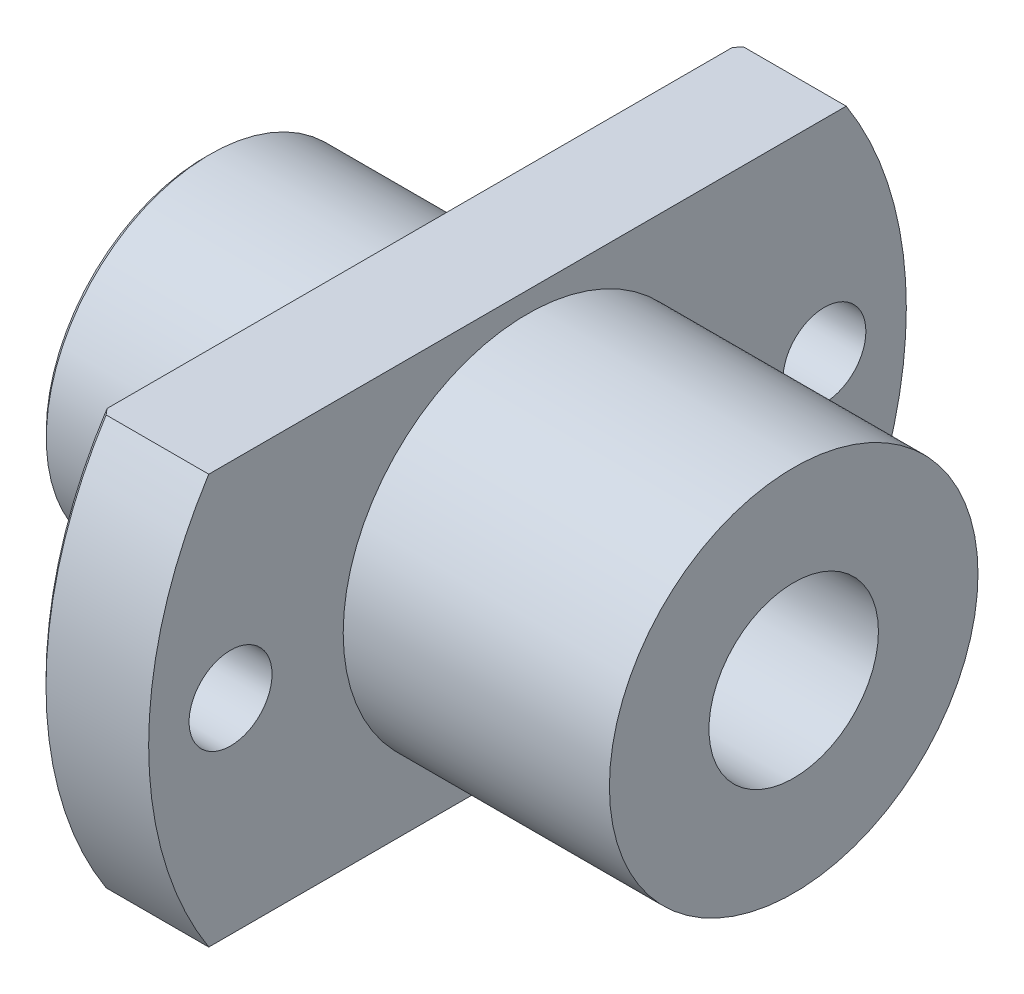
ISO-10303-21;
HEADER;
FILE_DESCRIPTION(('STEP AP214'),'2;1');
FILE_NAME('part.step','',(''),(''),'','','');
FILE_SCHEMA(('AUTOMOTIVE_DESIGN { 1 0 10303 214 1 1 1 1 }'));
ENDSEC;
DATA;
#1=APPLICATION_CONTEXT('core data for automotive mechanical design processes');
#2=APPLICATION_PROTOCOL_DEFINITION('international standard','automotive_design',2000,#1);
#3=PRODUCT_CONTEXT('',#1,'mechanical');
#4=PRODUCT('Part','Part','',(#3));
#5=PRODUCT_RELATED_PRODUCT_CATEGORY('part','',(#4));
#6=PRODUCT_DEFINITION_FORMATION('','',#4);
#7=PRODUCT_DEFINITION_CONTEXT('part definition',#1,'design');
#8=PRODUCT_DEFINITION('design','',#6,#7);
#9=PRODUCT_DEFINITION_SHAPE('','',#8);
#10=(LENGTH_UNIT() NAMED_UNIT(*) SI_UNIT(.MILLI.,.METRE.));
#11=(NAMED_UNIT(*) PLANE_ANGLE_UNIT() SI_UNIT($,.RADIAN.));
#12=(NAMED_UNIT(*) SI_UNIT($,.STERADIAN.) SOLID_ANGLE_UNIT());
#13=UNCERTAINTY_MEASURE_WITH_UNIT(LENGTH_MEASURE(1.E-05),#10,'distance_accuracy_value','');
#14=(GEOMETRIC_REPRESENTATION_CONTEXT(3) GLOBAL_UNCERTAINTY_ASSIGNED_CONTEXT((#13)) GLOBAL_UNIT_ASSIGNED_CONTEXT((#10,
#11,#12)) REPRESENTATION_CONTEXT('',''));
#15=CARTESIAN_POINT('',(0.,0.,0.));
#16=DIRECTION('',(0.,0.,1.));
#17=DIRECTION('',(1.,0.,0.));
#18=AXIS2_PLACEMENT_3D('',#15,#16,#17);
#19=CARTESIAN_POINT('',(71.8724099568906,0.,0.));
#20=DIRECTION('',(1.,0.,0.));
#21=DIRECTION('',(0.,0.,-1.));
#22=AXIS2_PLACEMENT_3D('',#19,#20,#21);
#23=CYLINDRICAL_SURFACE('',#22,37.);
#24=CARTESIAN_POINT('',(22.975,0.,0.));
#25=DIRECTION('',(1.,0.,0.));
#26=DIRECTION('',(0.,0.,-1.));
#27=AXIS2_PLACEMENT_3D('',#24,#25,#26);
#28=CIRCLE('',#27,37.);
#29=CARTESIAN_POINT('',(22.975,20.,31.1287648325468));
#30=VERTEX_POINT('',#29);
#31=CARTESIAN_POINT('',(22.975,-20.,31.1287648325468));
#32=VERTEX_POINT('',#31);
#33=EDGE_CURVE('E106',#30,#32,#28,.T.);
#34=ORIENTED_EDGE('',*,*,#33,.T.);
#35=DIRECTION('',(1.,0.,0.));
#36=VECTOR('',#35,1.);
#37=CARTESIAN_POINT('',(71.8724099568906,-20.,31.1287648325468));
#38=LINE('',#37,#36);
#39=CARTESIAN_POINT('',(33.,-20.,31.1287648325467));
#40=VERTEX_POINT('',#39);
#41=EDGE_CURVE('E88',#32,#40,#38,.T.);
#42=ORIENTED_EDGE('',*,*,#41,.T.);
#43=CARTESIAN_POINT('',(33.,0.,0.));
#44=DIRECTION('',(1.,0.,0.));
#45=DIRECTION('',(0.,0.,-1.));
#46=AXIS2_PLACEMENT_3D('',#43,#44,#45);
#47=CIRCLE('',#46,37.);
#48=CARTESIAN_POINT('',(33.,20.,31.1287648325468));
#49=VERTEX_POINT('',#48);
#50=EDGE_CURVE('E201',#40,#49,#47,.F.);
#51=ORIENTED_EDGE('',*,*,#50,.T.);
#52=DIRECTION('',(1.,0.,0.));
#53=VECTOR('',#52,1.);
#54=CARTESIAN_POINT('',(71.8724099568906,20.,31.1287648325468));
#55=LINE('',#54,#53);
#56=EDGE_CURVE('E200',#49,#30,#55,.F.);
#57=ORIENTED_EDGE('',*,*,#56,.T.);
#58=EDGE_LOOP('',(#34,#42,#51,#57));
#59=FACE_BOUND('',#58,.T.);
#60=ADVANCED_FACE('F33',(#59),#23,.T.);
#61=CARTESIAN_POINT('',(22.975,0.,0.));
#62=DIRECTION('',(1.,0.,0.));
#63=DIRECTION('',(0.,0.,-1.));
#64=AXIS2_PLACEMENT_3D('',#61,#62,#63);
#65=CONICAL_SURFACE('',#64,37.,0.785398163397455);
#66=CARTESIAN_POINT('',(67.3762135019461,-20.,78.906004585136));
#67=CARTESIAN_POINT('',(66.4795612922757,-20.,77.9809943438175));
#68=CARTESIAN_POINT('',(65.5833958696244,-20.,77.055512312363));
#69=CARTESIAN_POINT('',(63.7921560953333,-20.,75.2034920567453));
#70=CARTESIAN_POINT('',(62.8970817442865,-20.,74.2769538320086));
#71=CARTESIAN_POINT('',(60.2136464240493,-20.,71.495559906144));
#72=CARTESIAN_POINT('',(58.4270998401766,-20.,69.6389524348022));
#73=CARTESIAN_POINT('',(54.8588488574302,-20.,65.9186013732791));
#74=CARTESIAN_POINT('',(53.0771487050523,-20.,64.0548537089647));
#75=CARTESIAN_POINT('',(49.5215707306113,-20.,60.319934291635));
#76=CARTESIAN_POINT('',(47.7476928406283,-20.,58.4487626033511));
#77=CARTESIAN_POINT('',(45.0822402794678,-20.,55.6216301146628));
#78=CARTESIAN_POINT('',(44.186843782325,-20.,54.6692722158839));
#79=CARTESIAN_POINT('',(42.3991326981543,-20.,52.7616688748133));
#80=CARTESIAN_POINT('',(41.5068181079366,-20.,51.8064234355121));
#81=CARTESIAN_POINT('',(39.7257627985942,-20.,49.8925563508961));
#82=CARTESIAN_POINT('',(38.8370221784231,-20.,48.9339346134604));
#83=CARTESIAN_POINT('',(37.0637862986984,-20.,47.0127723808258));
#84=CARTESIAN_POINT('',(36.1792910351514,-20.,46.0502318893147));
#85=CARTESIAN_POINT('',(34.4156521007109,-20.,44.1208544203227));
#86=CARTESIAN_POINT('',(33.5365067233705,-20.,43.154019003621));
#87=CARTESIAN_POINT('',(31.7842897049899,-20.,41.2148474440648));
#88=CARTESIAN_POINT('',(30.9112180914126,-20.,40.2425112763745));
#89=CARTESIAN_POINT('',(29.1725238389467,-20.,38.2912806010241));
#90=CARTESIAN_POINT('',(28.3069008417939,-20.,37.312386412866));
#91=CARTESIAN_POINT('',(26.5848060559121,-20.,35.3465892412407));
#92=CARTESIAN_POINT('',(25.7283341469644,-20.,34.3596863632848));
#93=CARTESIAN_POINT('',(24.3149870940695,-20.,32.7118944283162));
#94=CARTESIAN_POINT('',(23.7548759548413,-20.,32.0537813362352));
#95=CARTESIAN_POINT('',(22.6405687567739,-20.,30.732556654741));
#96=CARTESIAN_POINT('',(22.0863727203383,-20.,30.0694450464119));
#97=CARTESIAN_POINT('',(20.9848563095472,-20.,28.7372656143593));
#98=CARTESIAN_POINT('',(20.4375375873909,-20.,28.0681964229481));
#99=CARTESIAN_POINT('',(19.3512865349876,-20.,26.7232815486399));
#100=CARTESIAN_POINT('',(18.8123541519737,-20.,26.0474359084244));
#101=CARTESIAN_POINT('',(17.7453787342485,-20.,24.6887360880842));
#102=CARTESIAN_POINT('',(17.2173213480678,-20.,24.0058931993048));
#103=CARTESIAN_POINT('',(16.1735428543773,-20.,22.6307854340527));
#104=CARTESIAN_POINT('',(15.6578221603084,-20.,21.9385202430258));
#105=CARTESIAN_POINT('',(14.6418579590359,-20.,20.5430660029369));
#106=CARTESIAN_POINT('',(14.141608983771,-20.,19.8398809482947));
#107=CARTESIAN_POINT('',(13.1603472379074,-20.,18.4202687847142));
#108=CARTESIAN_POINT('',(12.6793326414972,-20.,17.7038429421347));
#109=CARTESIAN_POINT('',(11.7586754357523,-20.,16.2813210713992));
#110=CARTESIAN_POINT('',(11.318165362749,-20.,15.5757908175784));
#111=CARTESIAN_POINT('',(10.6791853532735,-20.,14.5044359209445));
#112=CARTESIAN_POINT('',(10.4698048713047,-20.,14.1451078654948));
#113=CARTESIAN_POINT('',(10.0593198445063,-20.,13.4217446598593));
#114=CARTESIAN_POINT('',(9.85821529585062,-20.,13.0577095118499));
#115=CARTESIAN_POINT('',(9.4654685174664,-20.,12.3246843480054));
#116=CARTESIAN_POINT('',(9.27382357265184,-20.,11.9556957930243));
#117=CARTESIAN_POINT('',(8.9012582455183,-20.,11.2123466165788));
#118=CARTESIAN_POINT('',(8.72033832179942,-20.,10.837985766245));
#119=CARTESIAN_POINT('',(8.19592658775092,-20.,9.70652696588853));
#120=CARTESIAN_POINT('',(7.8706241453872,-20.,8.94076137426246));
#121=CARTESIAN_POINT('',(7.35240057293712,-20.,7.56935302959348));
#122=CARTESIAN_POINT('',(7.14636594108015,-20.,6.96867015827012));
#123=CARTESIAN_POINT('',(6.778159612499,-20.,5.75378226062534));
#124=CARTESIAN_POINT('',(6.61598356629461,-20.,5.13957858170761));
#125=CARTESIAN_POINT('',(6.41125157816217,-20.,4.21086423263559));
#126=CARTESIAN_POINT('',(6.34949127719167,-20.,3.90051262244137));
#127=CARTESIAN_POINT('',(6.23944374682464,-20.,3.27744251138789));
#128=CARTESIAN_POINT('',(6.19115492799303,-20.,2.96472429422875));
#129=CARTESIAN_POINT('',(6.10872253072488,-20.,2.33740838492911));
#130=CARTESIAN_POINT('',(6.07457970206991,-20.,2.02281059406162));
#131=CARTESIAN_POINT('',(6.0209511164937,-20.,1.39239726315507));
#132=CARTESIAN_POINT('',(6.00146372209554,-20.,1.07658186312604));
#133=CARTESIAN_POINT('',(5.97736007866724,-20.,0.442213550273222));
#134=CARTESIAN_POINT('',(5.97284666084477,-20.,0.123656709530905));
#135=CARTESIAN_POINT('',(5.97905114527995,-20.,-0.513307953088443));
#136=CARTESIAN_POINT('',(5.98976905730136,-20.,-0.831715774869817));
#137=CARTESIAN_POINT('',(6.02626523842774,-20.,-1.467654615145));
#138=CARTESIAN_POINT('',(6.05204308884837,-20.,-1.78518565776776));
#139=CARTESIAN_POINT('',(6.11826305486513,-20.,-2.41874420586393));
#140=CARTESIAN_POINT('',(6.15870686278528,-20.,-2.73477153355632));
#141=CARTESIAN_POINT('',(6.2537642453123,-20.,-3.36535703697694));
#142=CARTESIAN_POINT('',(6.30840719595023,-20.,-3.67991077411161));
#143=CARTESIAN_POINT('',(6.43106886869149,-20.,-4.30641238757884));
#144=CARTESIAN_POINT('',(6.49908914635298,-20.,-4.6183599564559));
#145=CARTESIAN_POINT('',(6.72194582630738,-20.,-5.54967130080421));
#146=CARTESIAN_POINT('',(6.89559303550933,-20.,-6.16459990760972));
#147=CARTESIAN_POINT('',(7.28218684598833,-20.,-7.37000297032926));
#148=CARTESIAN_POINT('',(7.49440289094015,-20.,-7.96071634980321));
#149=CARTESIAN_POINT('',(7.95329326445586,-20.,-9.12874153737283));
#150=CARTESIAN_POINT('',(8.19997970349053,-20.,-9.70604855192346));
#151=CARTESIAN_POINT('',(8.72206271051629,-20.,-10.8483816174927));
#152=CARTESIAN_POINT('',(8.99749818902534,-20.,-11.4133897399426));
#153=CARTESIAN_POINT('',(9.57168031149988,-20.,-12.5312924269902));
#154=CARTESIAN_POINT('',(9.87042464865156,-20.,-13.0841881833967));
#155=CARTESIAN_POINT('',(10.4895617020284,-20.,-14.1834994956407));
#156=CARTESIAN_POINT('',(10.8101083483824,-20.,-14.7298279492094));
#157=CARTESIAN_POINT('',(11.4672809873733,-20.,-15.8127017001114));
#158=CARTESIAN_POINT('',(11.8039072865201,-20.,-16.3492468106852));
#159=CARTESIAN_POINT('',(12.4902121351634,-20.,-17.4132595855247));
#160=CARTESIAN_POINT('',(12.8398793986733,-20.,-17.9407345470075));
#161=CARTESIAN_POINT('',(13.372726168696,-20.,-18.726247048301));
#162=CARTESIAN_POINT('',(13.5517305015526,-20.,-18.9871314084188));
#163=CARTESIAN_POINT('',(13.9123010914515,-20.,-19.5071240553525));
#164=CARTESIAN_POINT('',(14.0938673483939,-20.,-19.7662323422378));
#165=CARTESIAN_POINT('',(14.6716964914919,-20.,-20.5829119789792));
#166=CARTESIAN_POINT('',(15.0722752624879,-20.,-21.1374338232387));
#167=CARTESIAN_POINT('',(15.882626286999,-20.,-22.2397307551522));
#168=CARTESIAN_POINT('',(16.2923988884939,-20.,-22.787505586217));
#169=CARTESIAN_POINT('',(17.1197661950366,-20.,-23.8772320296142));
#170=CARTESIAN_POINT('',(17.5373620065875,-20.,-24.4191828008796));
#171=CARTESIAN_POINT('',(18.3791618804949,-20.,-25.4979102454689));
#172=CARTESIAN_POINT('',(18.8033658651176,-20.,-26.0346869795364));
#173=CARTESIAN_POINT('',(19.6576864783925,-20.,-27.1040002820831));
#174=CARTESIAN_POINT('',(20.0878062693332,-20.,-27.6365343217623));
#175=CARTESIAN_POINT('',(20.9529621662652,-20.,-28.6975963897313));
#176=CARTESIAN_POINT('',(21.3879983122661,-20.,-29.2261243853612));
#177=CARTESIAN_POINT('',(22.6994243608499,-20.,-30.8063253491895));
#178=CARTESIAN_POINT('',(23.5822004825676,-20.,-31.8527007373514));
#179=CARTESIAN_POINT('',(25.3624552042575,-20.,-33.9361813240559));
#180=CARTESIAN_POINT('',(26.2599579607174,-20.,-34.9732658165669));
#181=CARTESIAN_POINT('',(28.0652962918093,-20.,-37.0384173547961));
#182=CARTESIAN_POINT('',(28.9731320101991,-20.,-38.066484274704));
#183=CARTESIAN_POINT('',(30.7967670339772,-20.,-40.114937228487));
#184=CARTESIAN_POINT('',(31.7125637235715,-20.,-41.1353255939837));
#185=CARTESIAN_POINT('',(33.5508551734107,-20.,-43.1700369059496));
#186=CARTESIAN_POINT('',(34.4733499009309,-20.,-44.1843598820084));
#187=CARTESIAN_POINT('',(36.3213485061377,-20.,-46.205210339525));
#188=CARTESIAN_POINT('',(37.2468374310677,-20.,-47.211751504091));
#189=CARTESIAN_POINT('',(39.1023930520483,-20.,-49.2206047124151));
#190=CARTESIAN_POINT('',(40.0324597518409,-20.,-50.222916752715));
#191=CARTESIAN_POINT('',(41.8965159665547,-20.,-52.22402122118));
#192=CARTESIAN_POINT('',(42.8305057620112,-20.,-53.222813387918));
#193=CARTESIAN_POINT('',(44.7017685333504,-20.,-55.2173181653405));
#194=CARTESIAN_POINT('',(45.6390415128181,-20.,-56.2130307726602));
#195=CARTESIAN_POINT('',(48.4534325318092,-20.,-59.19447654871));
#196=CARTESIAN_POINT('',(50.3347423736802,-20.,-61.1762530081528));
#197=CARTESIAN_POINT('',(54.1057405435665,-20.,-65.1318150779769));
#198=CARTESIAN_POINT('',(55.9954288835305,-20.,-67.1056006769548));
#199=CARTESIAN_POINT('',(58.6769961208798,-20.,-69.8972963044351));
#200=CARTESIAN_POINT('',(59.4661963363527,-20.,-70.7177813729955));
#201=CARTESIAN_POINT('',(61.0457115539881,-20.,-72.3578646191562));
#202=CARTESIAN_POINT('',(61.8360266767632,-20.,-73.1774626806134));
#203=CARTESIAN_POINT('',(63.4175500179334,-20.,-74.8157352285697));
#204=CARTESIAN_POINT('',(64.2087582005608,-20.,-75.6344097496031));
#205=CARTESIAN_POINT('',(65.7919221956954,-20.,-77.2708471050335));
#206=CARTESIAN_POINT('',(66.5838779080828,-20.,-78.0886100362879));
#207=CARTESIAN_POINT('',(67.3762135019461,-20.,-78.906004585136));
#208=B_SPLINE_CURVE_WITH_KNOTS('',3,(#66,#67,#68,#69,#70,#71,#72,#73,#74,#75,#76,#77,#78,#79,
#80,#81,#82,#83,#84,#85,#86,#87,#88,#89,#90,#91,#92,#93,#94,#95,#96,#97,#98,#99,#100,#101,#102,
#103,#104,#105,#106,#107,#108,#109,#110,#111,#112,#113,#114,#115,#116,#117,#118,#119,#120,#121,
#122,#123,#124,#125,#126,#127,#128,#129,#130,#131,#132,#133,#134,#135,#136,#137,#138,#139,#140,
#141,#142,#143,#144,#145,#146,#147,#148,#149,#150,#151,#152,#153,#154,#155,#156,#157,#158,#159,
#160,#161,#162,#163,#164,#165,#166,#167,#168,#169,#170,#171,#172,#173,#174,#175,#176,#177,#178,
#179,#180,#181,#182,#183,#184,#185,#186,#187,#188,#189,#190,#191,#192,#193,#194,#195,#196,#197,
#198,#199,#200,#201,#202,#203,#204,#205,#206,#207),.UNSPECIFIED.,.F.,.F.,(4,2,2,2,2,2,2,2,2,2,2,
2,2,2,2,2,2,2,2,2,2,2,2,2,2,2,2,2,2,2,2,2,2,2,2,2,2,2,2,2,2,2,2,2,2,2,2,2,2,2,2,2,2,2,2,2,2,2,2,
2,2,2,2,2,2,2,2,2,2,2,4),(0.,3.86479742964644,7.72959695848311,15.4593108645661,
23.1944161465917,30.9294541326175,34.850989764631,38.7725213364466,42.6941607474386,
46.6157964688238,50.5361077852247,54.4564368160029,58.3765762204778,62.2966640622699,
64.889228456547,67.4818026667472,70.0749882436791,72.6681574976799,75.2576512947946,
77.8472317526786,80.4358862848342,83.0242945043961,85.5189474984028,86.7665002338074,
88.0140523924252,89.2612443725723,90.5084896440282,93.001986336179,94.905796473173,
96.8094177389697,97.7584842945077,98.707438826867,99.6564436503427,100.605342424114,
101.560744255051,102.51614669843,103.471522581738,104.427008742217,105.3844876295,
106.342077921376,108.256967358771,110.138783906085,112.021263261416,113.906324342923,
115.79119910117,117.691137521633,119.591112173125,121.489479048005,122.438639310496,
123.387799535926,125.439896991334,127.492072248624,129.5445399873,131.596983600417,
133.650570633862,135.704174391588,139.811053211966,143.925521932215,148.04004796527,
152.153269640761,156.266471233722,160.368514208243,164.470560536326,168.572905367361,
172.675254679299,180.872832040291,189.070421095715,192.485723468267,195.901429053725,
199.317002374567,202.732169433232),.UNSPECIFIED.);
#209=CARTESIAN_POINT('',(22.475,-20.,30.532769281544));
#210=VERTEX_POINT('',#209);
#211=EDGE_CURVE('E85',#32,#210,#208,.T.);
#212=ORIENTED_EDGE('',*,*,#211,.F.);
#213=ORIENTED_EDGE('',*,*,#33,.F.);
#214=CARTESIAN_POINT('',(65.8913090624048,20.,-77.3732282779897));
#215=CARTESIAN_POINT('',(65.0235036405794,20.,-76.4768964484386));
#216=CARTESIAN_POINT('',(64.1561817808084,20.,-75.5800964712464));
#217=CARTESIAN_POINT('',(62.4226204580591,20.,-73.7854500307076));
#218=CARTESIAN_POINT('',(61.5563809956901,20.,-72.8876035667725));
#219=CARTESIAN_POINT('',(58.9594369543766,20.,-70.1923061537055));
#220=CARTESIAN_POINT('',(57.2305304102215,20.,-68.3931216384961));
#221=CARTESIAN_POINT('',(53.7777442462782,20.,-64.7879721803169));
#222=CARTESIAN_POINT('',(52.0538680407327,20.,-62.9820039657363));
#223=CARTESIAN_POINT('',(48.6138190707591,20.,-59.3627669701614));
#224=CARTESIAN_POINT('',(46.8976462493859,20.,-57.5494982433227));
#225=CARTESIAN_POINT('',(43.5109822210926,20.,-53.9513841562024));
#226=CARTESIAN_POINT('',(41.8402842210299,20.,-52.1667337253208));
#227=CARTESIAN_POINT('',(39.3438789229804,20.,-49.4807603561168));
#228=CARTESIAN_POINT('',(38.5133415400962,20.,-48.5839261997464));
#229=CARTESIAN_POINT('',(36.8560469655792,20.,-46.7867711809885));
#230=CARTESIAN_POINT('',(36.02928977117,20.,-45.8864503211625));
#231=CARTESIAN_POINT('',(34.3804298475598,20.,-44.0819685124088));
#232=CARTESIAN_POINT('',(33.5583260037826,20.,-43.1778085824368));
#233=CARTESIAN_POINT('',(31.9194032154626,20.,-41.3647022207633));
#234=CARTESIAN_POINT('',(31.1025842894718,20.,-40.4557557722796));
#235=CARTESIAN_POINT('',(29.475335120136,20.,-38.6322211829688));
#236=CARTESIAN_POINT('',(28.6649046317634,20.,-37.7176332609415));
#237=CARTESIAN_POINT('',(27.051777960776,20.,-35.8816677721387));
#238=CARTESIAN_POINT('',(26.2490816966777,20.,-34.9602902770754));
#239=CARTESIAN_POINT('',(24.9838506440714,20.,-33.4927696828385));
#240=CARTESIAN_POINT('',(24.5181779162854,20.,-32.9493313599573));
#241=CARTESIAN_POINT('',(23.5905702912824,20.,-31.8592709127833));
#242=CARTESIAN_POINT('',(23.12863539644,20.,-31.3126487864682));
#243=CARTESIAN_POINT('',(22.2089991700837,20.,-30.215758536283));
#244=CARTESIAN_POINT('',(21.7512982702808,20.,-29.6654900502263));
#245=CARTESIAN_POINT('',(20.8408307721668,20.,-28.5608819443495));
#246=CARTESIAN_POINT('',(20.3880641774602,20.,-28.0065423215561));
#247=CARTESIAN_POINT('',(19.483369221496,20.,-26.8871834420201));
#248=CARTESIAN_POINT('',(19.0315033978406,20.,-26.3221135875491));
#249=CARTESIAN_POINT('',(18.1346219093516,20.,-25.1865555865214));
#250=CARTESIAN_POINT('',(17.689606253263,20.,-24.6160674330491));
#251=CARTESIAN_POINT('',(16.8077574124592,20.,-23.4689895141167));
#252=CARTESIAN_POINT('',(16.3709224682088,20.,-22.89240110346));
#253=CARTESIAN_POINT('',(15.5068765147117,20.,-21.7320438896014));
#254=CARTESIAN_POINT('',(15.0796655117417,20.,-21.1482750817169));
#255=CARTESIAN_POINT('',(14.2301735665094,20.,-19.9631732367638));
#256=CARTESIAN_POINT('',(13.8080760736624,20.,-19.3617083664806));
#257=CARTESIAN_POINT('',(12.9783943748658,20.,-18.1488033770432));
#258=CARTESIAN_POINT('',(12.570810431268,20.,-17.5373630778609));
#259=CARTESIAN_POINT('',(11.7729258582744,20.,-16.3020163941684));
#260=CARTESIAN_POINT('',(11.382650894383,20.,-15.678093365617));
#261=CARTESIAN_POINT('',(10.6243547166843,20.,-14.4168200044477));
#262=CARTESIAN_POINT('',(10.2563328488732,20.,-13.7794700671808));
#263=CARTESIAN_POINT('',(9.55264639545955,20.,-12.4975529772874));
#264=CARTESIAN_POINT('',(9.21663067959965,20.,-11.8531798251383));
#265=CARTESIAN_POINT('',(8.57865279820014,20.,-10.5474901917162));
#266=CARTESIAN_POINT('',(8.27669666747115,20.,-9.88617073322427));
#267=CARTESIAN_POINT('',(7.71638789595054,20.,-8.54731241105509));
#268=CARTESIAN_POINT('',(7.4579159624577,20.,-7.86982394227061));
#269=CARTESIAN_POINT('',(6.99392699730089,20.,-6.49703571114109));
#270=CARTESIAN_POINT('',(6.78837517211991,20.,-5.8017479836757));
#271=CARTESIAN_POINT('',(6.53357867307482,20.,-4.77038403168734));
#272=CARTESIAN_POINT('',(6.45941655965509,20.,-4.4403671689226));
#273=CARTESIAN_POINT('',(6.32599576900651,20.,-3.77735149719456));
#274=CARTESIAN_POINT('',(6.26673501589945,20.,-3.44435311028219));
#275=CARTESIAN_POINT('',(6.16402162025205,20.,-2.77590877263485));
#276=CARTESIAN_POINT('',(6.12056951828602,20.,-2.44046273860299));
#277=CARTESIAN_POINT('',(6.05019262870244,20.,-1.76782761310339));
#278=CARTESIAN_POINT('',(6.02326803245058,20.,-1.4306385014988));
#279=CARTESIAN_POINT('',(5.98646773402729,20.,-0.75623838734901));
#280=CARTESIAN_POINT('',(5.97654628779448,20.,-0.419029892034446));
#281=CARTESIAN_POINT('',(5.97378816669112,20.,0.255455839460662));
#282=CARTESIAN_POINT('',(5.98095141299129,20.,0.592733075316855));
#283=CARTESIAN_POINT('',(6.01223562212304,20.,1.26652159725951));
#284=CARTESIAN_POINT('',(6.03635784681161,20.,1.60303282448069));
#285=CARTESIAN_POINT('',(6.10113880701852,20.,2.27445183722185));
#286=CARTESIAN_POINT('',(6.14179760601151,20.,2.60935961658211));
#287=CARTESIAN_POINT('',(6.23853093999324,20.,3.27379222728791));
#288=CARTESIAN_POINT('',(6.29446034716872,20.,3.60333824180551));
#289=CARTESIAN_POINT('',(6.42103823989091,20.,4.25960491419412));
#290=CARTESIAN_POINT('',(6.49168879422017,20.,4.58632516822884));
#291=CARTESIAN_POINT('',(6.72427352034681,20.,5.56152688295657));
#292=CARTESIAN_POINT('',(6.90686180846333,20.,6.20518893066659));
#293=CARTESIAN_POINT('',(7.21611258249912,20.,7.16076811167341));
#294=CARTESIAN_POINT('',(7.32544393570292,20.,7.4785100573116));
#295=CARTESIAN_POINT('',(7.55480058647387,20.,8.11013628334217));
#296=CARTESIAN_POINT('',(7.67482593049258,20.,8.42402054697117));
#297=CARTESIAN_POINT('',(7.9245193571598,20.,9.04782377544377));
#298=CARTESIAN_POINT('',(8.05418511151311,20.,9.35774367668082));
#299=CARTESIAN_POINT('',(8.32223971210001,20.,9.9737648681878));
#300=CARTESIAN_POINT('',(8.46062831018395,20.,10.2798662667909));
#301=CARTESIAN_POINT('',(8.89600621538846,20.,11.2106882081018));
#302=CARTESIAN_POINT('',(9.2057278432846,20.,11.8294766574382));
#303=CARTESIAN_POINT('',(9.85197878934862,20.,13.0529674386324));
#304=CARTESIAN_POINT('',(10.18851578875,20.,13.6576656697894));
#305=CARTESIAN_POINT('',(10.8835626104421,20.,14.8551136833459));
#306=CARTESIAN_POINT('',(11.242095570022,20.,15.4478499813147));
#307=CARTESIAN_POINT('',(11.9767038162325,20.,16.6222262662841));
#308=CARTESIAN_POINT('',(12.3527775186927,20.,17.2038672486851));
#309=CARTESIAN_POINT('',(13.1208423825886,20.,18.3598486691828));
#310=CARTESIAN_POINT('',(13.5128908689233,20.,18.9341509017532));
#311=CARTESIAN_POINT('',(14.3089754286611,20.,20.0743794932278));
#312=CARTESIAN_POINT('',(14.7130117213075,20.,20.6403056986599));
#313=CARTESIAN_POINT('',(15.5308451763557,20.,21.7645731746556));
#314=CARTESIAN_POINT('',(15.9446368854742,20.,22.3229184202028));
#315=CARTESIAN_POINT('',(16.7806029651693,20.,23.4332809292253));
#316=CARTESIAN_POINT('',(17.2027772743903,20.,23.9852982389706));
#317=CARTESIAN_POINT('',(18.059893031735,20.,25.0911140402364));
#318=CARTESIAN_POINT('',(18.4949295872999,20.,25.6448387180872));
#319=CARTESIAN_POINT('',(19.3712281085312,20.,26.7473347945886));
#320=CARTESIAN_POINT('',(19.8124900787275,20.,27.2961061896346));
#321=CARTESIAN_POINT('',(20.7004065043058,20.,28.3893567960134));
#322=CARTESIAN_POINT('',(21.1470614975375,20.,28.9338355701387));
#323=CARTESIAN_POINT('',(22.0450058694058,20.,30.0189604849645));
#324=CARTESIAN_POINT('',(22.4962952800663,20.,30.5596065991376));
#325=CARTESIAN_POINT('',(23.8539539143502,20.,32.1738145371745));
#326=CARTESIAN_POINT('',(24.7663125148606,20.,33.2423409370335));
#327=CARTESIAN_POINT('',(26.6033474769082,20.,35.3687543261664));
#328=CARTESIAN_POINT('',(27.5280240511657,20.,36.4266411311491));
#329=CARTESIAN_POINT('',(29.2270493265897,20.,38.3524193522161));
#330=CARTESIAN_POINT('',(29.9998684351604,20.,39.2216619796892));
#331=CARTESIAN_POINT('',(31.5510589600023,20.,40.9551812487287));
#332=CARTESIAN_POINT('',(32.3294303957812,20.,41.8194578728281));
#333=CARTESIAN_POINT('',(33.8908544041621,20.,43.5438046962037));
#334=CARTESIAN_POINT('',(34.6739070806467,20.,44.4038748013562));
#335=CARTESIAN_POINT('',(36.2439781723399,20.,46.120388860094));
#336=CARTESIAN_POINT('',(37.0309965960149,20.,46.9768328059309));
#337=CARTESIAN_POINT('',(39.3986129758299,20.,49.5431106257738));
#338=CARTESIAN_POINT('',(40.9842902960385,20.,51.2482587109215));
#339=CARTESIAN_POINT('',(44.1657519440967,20.,54.6490951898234));
#340=CARTESIAN_POINT('',(45.7615363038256,20.,56.3447835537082));
#341=CARTESIAN_POINT('',(48.1282879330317,20.,58.8481152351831));
#342=CARTESIAN_POINT('',(48.8962524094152,20.,59.6586003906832));
#343=CARTESIAN_POINT('',(50.4337812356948,20.,61.2780481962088));
#344=CARTESIAN_POINT('',(51.2033455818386,20.,62.0870108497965));
#345=CARTESIAN_POINT('',(53.5141820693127,20.,64.5118702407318));
#346=CARTESIAN_POINT('',(55.0575907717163,20.,66.125731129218));
#347=CARTESIAN_POINT('',(58.147256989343,20.,69.3472625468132));
#348=CARTESIAN_POINT('',(59.6935093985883,20.,70.9549379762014));
#349=CARTESIAN_POINT('',(62.7897792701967,20.,74.1666351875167));
#350=CARTESIAN_POINT('',(64.3397967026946,20.,75.770656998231));
#351=CARTESIAN_POINT('',(65.8913090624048,20.,77.3732282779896));
#352=B_SPLINE_CURVE_WITH_KNOTS('',3,(#214,#215,#216,#217,#218,#219,#220,#221,#222,#223,#224,
#225,#226,#227,#228,#229,#230,#231,#232,#233,#234,#235,#236,#237,#238,#239,#240,#241,#242,#243,
#244,#245,#246,#247,#248,#249,#250,#251,#252,#253,#254,#255,#256,#257,#258,#259,#260,#261,#262,
#263,#264,#265,#266,#267,#268,#269,#270,#271,#272,#273,#274,#275,#276,#277,#278,#279,#280,#281,
#282,#283,#284,#285,#286,#287,#288,#289,#290,#291,#292,#293,#294,#295,#296,#297,#298,#299,#300,
#301,#302,#303,#304,#305,#306,#307,#308,#309,#310,#311,#312,#313,#314,#315,#316,#317,#318,#319,
#320,#321,#322,#323,#324,#325,#326,#327,#328,#329,#330,#331,#332,#333,#334,#335,#336,#337,#338,
#339,#340,#341,#342,#343,#344,#345,#346,#347,#348,#349,#350,#351),.UNSPECIFIED.,.F.,.F.,(4,2,2,
2,2,2,2,2,2,2,2,2,2,2,2,2,2,2,2,2,2,2,2,2,2,2,2,2,2,2,2,2,2,2,2,2,2,2,2,2,2,2,2,2,2,2,2,2,2,2,2,
2,2,2,2,2,2,2,2,2,2,2,2,2,2,2,2,2,4),(0.,3.74278914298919,7.48558039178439,14.9712650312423,
22.4612027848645,29.9510850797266,37.2849164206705,40.9519141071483,44.6189091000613,
48.2849850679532,51.9510738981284,55.6170214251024,59.2829302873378,61.4299113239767,
63.5768937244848,65.7240926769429,67.8712931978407,70.0418194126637,72.2123483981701,
74.3824050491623,76.5524631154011,78.7566790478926,80.9609348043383,83.1683566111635,
85.3757135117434,87.5550800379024,89.7348321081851,91.9085032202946,94.0807415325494,
95.0952024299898,96.1095219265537,97.1238761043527,98.1382420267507,99.1498746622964,
100.161502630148,101.173205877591,102.184913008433,103.187321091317,104.189870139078,
106.194545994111,107.202494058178,108.21044650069,109.218156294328,110.225837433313,
112.300844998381,114.376449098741,116.454275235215,118.531914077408,120.61781076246,
122.703745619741,124.788540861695,126.873320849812,128.985805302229,131.098291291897,
133.210989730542,135.323702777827,139.538695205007,143.753760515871,147.24307266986,
150.732397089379,154.221799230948,157.711208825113,164.696640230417,171.682093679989,
175.031703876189,178.381306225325,185.080540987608,191.772294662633,198.463995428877),.UNSPECIFIED.);
#353=CARTESIAN_POINT('',(22.475,20.,30.532769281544));
#354=VERTEX_POINT('',#353);
#355=EDGE_CURVE('E105',#354,#30,#352,.T.);
#356=ORIENTED_EDGE('',*,*,#355,.F.);
#357=CARTESIAN_POINT('',(22.475,0.,0.));
#358=DIRECTION('',(1.,0.,0.));
#359=DIRECTION('',(0.,0.,-1.));
#360=AXIS2_PLACEMENT_3D('',#357,#358,#359);
#361=CIRCLE('',#360,36.5);
#362=EDGE_CURVE('E55',#210,#354,#361,.F.);
#363=ORIENTED_EDGE('',*,*,#362,.F.);
#364=EDGE_LOOP('',(#212,#213,#356,#363));
#365=FACE_BOUND('',#364,.T.);
#366=ADVANCED_FACE('F104',(#365),#65,.T.);
#367=CARTESIAN_POINT('',(33.,46.0310400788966,0.));
#368=DIRECTION('',(1.,0.,0.));
#369=DIRECTION('',(0.,0.,-1.));
#370=AXIS2_PLACEMENT_3D('',#367,#368,#369);
#371=PLANE('',#370);
#372=CARTESIAN_POINT('',(33.,0.,-29.));
#373=DIRECTION('',(1.,0.,0.));
#374=DIRECTION('',(0.,0.,-1.));
#375=AXIS2_PLACEMENT_3D('',#372,#373,#374);
#376=CIRCLE('',#375,4.04999999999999);
#377=CARTESIAN_POINT('',(33.,0.,-33.05));
#378=VERTEX_POINT('',#377);
#379=EDGE_CURVE('E264',#378,#378,#376,.T.);
#380=ORIENTED_EDGE('',*,*,#379,.F.);
#381=EDGE_LOOP('',(#380));
#382=FACE_BOUND('',#381,.T.);
#383=CARTESIAN_POINT('',(33.,0.,29.));
#384=DIRECTION('',(1.,0.,0.));
#385=DIRECTION('',(0.,0.,-1.));
#386=AXIS2_PLACEMENT_3D('',#383,#384,#385);
#387=CIRCLE('',#386,4.04999999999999);
#388=CARTESIAN_POINT('',(33.,0.,24.95));
#389=VERTEX_POINT('',#388);
#390=EDGE_CURVE('E101',#389,#389,#387,.T.);
#391=ORIENTED_EDGE('',*,*,#390,.F.);
#392=EDGE_LOOP('',(#391));
#393=FACE_BOUND('',#392,.T.);
#394=DIRECTION('',(0.,0.,1.));
#395=VECTOR('',#394,1.);
#396=CARTESIAN_POINT('',(33.,-20.,0.));
#397=LINE('',#396,#395);
#398=CARTESIAN_POINT('',(33.,-20.,-31.1287648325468));
#399=VERTEX_POINT('',#398);
#400=EDGE_CURVE('E256',#399,#40,#397,.T.);
#401=ORIENTED_EDGE('',*,*,#400,.F.);
#402=CARTESIAN_POINT('',(33.,20.,-31.1287648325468));
#403=VERTEX_POINT('',#402);
#404=EDGE_CURVE('E220',#403,#399,#47,.F.);
#405=ORIENTED_EDGE('',*,*,#404,.F.);
#406=DIRECTION('',(0.,0.,-1.));
#407=VECTOR('',#406,1.);
#408=CARTESIAN_POINT('',(33.,20.,0.));
#409=LINE('',#408,#407);
#410=EDGE_CURVE('E203',#49,#403,#409,.T.);
#411=ORIENTED_EDGE('',*,*,#410,.F.);
#412=ORIENTED_EDGE('',*,*,#50,.F.);
#413=EDGE_LOOP('',(#401,#405,#411,#412));
#414=FACE_BOUND('',#413,.T.);
#415=CARTESIAN_POINT('',(33.,0.,0.));
#416=DIRECTION('',(-1.,0.,0.));
#417=DIRECTION('',(0.,0.,1.));
#418=AXIS2_PLACEMENT_3D('',#415,#416,#417);
#419=CIRCLE('',#418,18.);
#420=CARTESIAN_POINT('',(33.,0.,18.));
#421=VERTEX_POINT('',#420);
#422=EDGE_CURVE('E223',#421,#421,#419,.T.);
#423=ORIENTED_EDGE('',*,*,#422,.T.);
#424=EDGE_LOOP('',(#423));
#425=FACE_BOUND('',#424,.T.);
#426=ADVANCED_FACE('F168',(#382,#393,#414,#425),#371,.T.);
#427=CARTESIAN_POINT('',(-12.510753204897,0.,0.));
#428=DIRECTION('',(-1.,0.,0.));
#429=DIRECTION('',(0.,0.,1.));
#430=AXIS2_PLACEMENT_3D('',#427,#428,#429);
#431=CYLINDRICAL_SURFACE('',#430,18.);
#432=CARTESIAN_POINT('',(59.,0.,0.));
#433=DIRECTION('',(-1.,0.,0.));
#434=DIRECTION('',(0.,0.,1.));
#435=AXIS2_PLACEMENT_3D('',#432,#433,#434);
#436=CIRCLE('',#435,18.);
#437=CARTESIAN_POINT('',(59.,0.,18.));
#438=VERTEX_POINT('',#437);
#439=EDGE_CURVE('E219',#438,#438,#436,.T.);
#440=ORIENTED_EDGE('',*,*,#439,.T.);
#441=EDGE_LOOP('',(#440));
#442=FACE_BOUND('',#441,.T.);
#443=ORIENTED_EDGE('',*,*,#422,.F.);
#444=EDGE_LOOP('',(#443));
#445=FACE_BOUND('',#444,.T.);
#446=ADVANCED_FACE('F164',(#442,#445),#431,.T.);
#447=CARTESIAN_POINT('',(59.,18.,0.));
#448=DIRECTION('',(1.,0.,0.));
#449=DIRECTION('',(0.,0.,-1.));
#450=AXIS2_PLACEMENT_3D('',#447,#448,#449);
#451=PLANE('',#450);
#452=CARTESIAN_POINT('',(59.,0.,0.));
#453=DIRECTION('',(1.,0.,0.));
#454=DIRECTION('',(0.,0.,-1.));
#455=AXIS2_PLACEMENT_3D('',#452,#453,#454);
#456=CIRCLE('',#455,8.275);
#457=CARTESIAN_POINT('',(59.,0.,-8.275));
#458=VERTEX_POINT('',#457);
#459=EDGE_CURVE('E216',#458,#458,#456,.T.);
#460=ORIENTED_EDGE('',*,*,#459,.F.);
#461=EDGE_LOOP('',(#460));
#462=FACE_BOUND('',#461,.T.);
#463=ORIENTED_EDGE('',*,*,#439,.F.);
#464=EDGE_LOOP('',(#463));
#465=FACE_BOUND('',#464,.T.);
#466=ADVANCED_FACE('F160',(#462,#465),#451,.T.);
#467=CARTESIAN_POINT('',(0.,0.,0.));
#468=DIRECTION('',(1.,0.,0.));
#469=DIRECTION('',(0.,0.,-1.));
#470=AXIS2_PLACEMENT_3D('',#467,#468,#469);
#471=CYLINDRICAL_SURFACE('',#470,8.275);
#472=CARTESIAN_POINT('',(16.7000000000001,0.,0.));
#473=DIRECTION('',(1.,0.,0.));
#474=DIRECTION('',(0.,0.,-1.));
#475=AXIS2_PLACEMENT_3D('',#472,#473,#474);
#476=CIRCLE('',#475,8.275);
#477=CARTESIAN_POINT('',(16.7000000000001,0.,-8.275));
#478=VERTEX_POINT('',#477);
#479=EDGE_CURVE('E234',#478,#478,#476,.F.);
#480=CARTESIAN_POINT('',(16.7000000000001,0.,-8.275));
#481=CARTESIAN_POINT('',(17.1406250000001,0.,-8.275));
#482=CARTESIAN_POINT('',(17.5812500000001,0.,-8.275));
#483=CARTESIAN_POINT('',(18.4625000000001,0.,-8.275));
#484=CARTESIAN_POINT('',(18.9031250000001,0.,-8.275));
#485=CARTESIAN_POINT('',(19.7843750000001,0.,-8.275));
#486=CARTESIAN_POINT('',(20.2250000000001,0.,-8.275));
#487=CARTESIAN_POINT('',(21.1062500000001,0.,-8.275));
#488=CARTESIAN_POINT('',(21.5468750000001,0.,-8.275));
#489=CARTESIAN_POINT('',(22.4281250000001,0.,-8.275));
#490=CARTESIAN_POINT('',(22.8687500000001,0.,-8.275));
#491=CARTESIAN_POINT('',(23.7500000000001,0.,-8.275));
#492=CARTESIAN_POINT('',(24.1906250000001,0.,-8.275));
#493=CARTESIAN_POINT('',(25.071875,0.,-8.275));
#494=CARTESIAN_POINT('',(25.5125,0.,-8.275));
#495=CARTESIAN_POINT('',(26.39375,0.,-8.275));
#496=CARTESIAN_POINT('',(26.834375,0.,-8.275));
#497=CARTESIAN_POINT('',(27.715625,0.,-8.275));
#498=CARTESIAN_POINT('',(28.15625,0.,-8.275));
#499=CARTESIAN_POINT('',(29.0375,0.,-8.275));
#500=CARTESIAN_POINT('',(29.478125,0.,-8.275));
#501=CARTESIAN_POINT('',(30.359375,0.,-8.275));
#502=CARTESIAN_POINT('',(30.8,0.,-8.275));
#503=CARTESIAN_POINT('',(31.68125,0.,-8.275));
#504=CARTESIAN_POINT('',(32.121875,0.,-8.275));
#505=CARTESIAN_POINT('',(33.003125,0.,-8.275));
#506=CARTESIAN_POINT('',(33.44375,0.,-8.275));
#507=CARTESIAN_POINT('',(34.325,0.,-8.275));
#508=CARTESIAN_POINT('',(34.765625,0.,-8.275));
#509=CARTESIAN_POINT('',(35.646875,0.,-8.275));
#510=CARTESIAN_POINT('',(36.0875,0.,-8.275));
#511=CARTESIAN_POINT('',(36.96875,0.,-8.275));
#512=CARTESIAN_POINT('',(37.409375,0.,-8.275));
#513=CARTESIAN_POINT('',(38.290625,0.,-8.275));
#514=CARTESIAN_POINT('',(38.73125,0.,-8.275));
#515=CARTESIAN_POINT('',(39.6125,0.,-8.275));
#516=CARTESIAN_POINT('',(40.053125,0.,-8.275));
#517=CARTESIAN_POINT('',(40.934375,0.,-8.275));
#518=CARTESIAN_POINT('',(41.375,0.,-8.275));
#519=CARTESIAN_POINT('',(42.25625,0.,-8.275));
#520=CARTESIAN_POINT('',(42.696875,0.,-8.275));
#521=CARTESIAN_POINT('',(43.578125,0.,-8.275));
#522=CARTESIAN_POINT('',(44.01875,0.,-8.275));
#523=CARTESIAN_POINT('',(44.9,0.,-8.275));
#524=CARTESIAN_POINT('',(45.340625,0.,-8.275));
#525=CARTESIAN_POINT('',(46.221875,0.,-8.275));
#526=CARTESIAN_POINT('',(46.6625,0.,-8.275));
#527=CARTESIAN_POINT('',(47.54375,0.,-8.275));
#528=CARTESIAN_POINT('',(47.984375,0.,-8.275));
#529=CARTESIAN_POINT('',(48.865625,0.,-8.275));
#530=CARTESIAN_POINT('',(49.30625,0.,-8.275));
#531=CARTESIAN_POINT('',(50.1875,0.,-8.275));
#532=CARTESIAN_POINT('',(50.628125,0.,-8.275));
#533=CARTESIAN_POINT('',(51.509375,0.,-8.275));
#534=CARTESIAN_POINT('',(51.95,0.,-8.275));
#535=CARTESIAN_POINT('',(52.83125,0.,-8.275));
#536=CARTESIAN_POINT('',(53.271875,0.,-8.275));
#537=CARTESIAN_POINT('',(54.153125,0.,-8.275));
#538=CARTESIAN_POINT('',(54.59375,0.,-8.275));
#539=CARTESIAN_POINT('',(55.475,0.,-8.275));
#540=CARTESIAN_POINT('',(55.915625,0.,-8.275));
#541=CARTESIAN_POINT('',(56.796875,0.,-8.275));
#542=CARTESIAN_POINT('',(57.2375,0.,-8.275));
#543=CARTESIAN_POINT('',(58.11875,0.,-8.275));
#544=CARTESIAN_POINT('',(58.559375,0.,-8.275));
#545=CARTESIAN_POINT('',(59.,0.,-8.275));
#546=B_SPLINE_CURVE_WITH_KNOTS('',3,(#480,#481,#482,#483,#484,#485,#486,#487,#488,#489,#490,
#491,#492,#493,#494,#495,#496,#497,#498,#499,#500,#501,#502,#503,#504,#505,#506,#507,#508,#509,
#510,#511,#512,#513,#514,#515,#516,#517,#518,#519,#520,#521,#522,#523,#524,#525,#526,#527,#528,
#529,#530,#531,#532,#533,#534,#535,#536,#537,#538,#539,#540,#541,#542,#543,#544,#545),
.UNSPECIFIED.,.F.,.F.,(4,2,2,2,2,2,2,2,2,2,2,2,2,2,2,2,2,2,2,2,2,2,2,2,2,2,2,2,2,2,2,2,4),(0.,
1.321875,2.64375,3.96562499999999,5.28749999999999,6.60937499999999,7.93124999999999,
9.25312499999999,10.575,11.896875,13.21875,14.540625,15.8625,17.184375,18.50625,19.828125,21.15,
22.471875,23.79375,25.115625,26.4375,27.759375,29.08125,30.403125,31.725,33.046875,34.36875,
35.690625,37.0125,38.334375,39.65625,40.9781249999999,42.2999999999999),.UNSPECIFIED.);
#547=EDGE_CURVE('BSEAM137',#478,#458,#546,.T.);
#548=ORIENTED_EDGE('',*,*,#479,.T.);
#549=ORIENTED_EDGE('',*,*,#459,.T.);
#550=ORIENTED_EDGE('',*,*,#547,.T.);
#551=ORIENTED_EDGE('',*,*,#547,.F.);
#552=EDGE_LOOP('',(#548,#550,#549,#551));
#553=FACE_BOUND('',#552,.T.);
#554=ADVANCED_FACE('F137',(#553),#471,.F.);
#555=CARTESIAN_POINT('',(16.5,9.00999999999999,0.));
#556=DIRECTION('',(1.,0.,0.));
#557=DIRECTION('',(0.,0.,-1.));
#558=AXIS2_PLACEMENT_3D('',#555,#556,#557);
#559=PLANE('',#558);
#560=CARTESIAN_POINT('',(16.5,0.,0.));
#561=DIRECTION('',(1.,0.,0.));
#562=DIRECTION('',(0.,0.,-1.));
#563=AXIS2_PLACEMENT_3D('',#560,#561,#562);
#564=CIRCLE('',#563,8.47500000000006);
#565=CARTESIAN_POINT('',(16.5,0.,-8.47500000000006));
#566=VERTEX_POINT('',#565);
#567=EDGE_CURVE('E237',#566,#566,#564,.T.);
#568=ORIENTED_EDGE('',*,*,#567,.T.);
#569=EDGE_LOOP('',(#568));
#570=FACE_BOUND('',#569,.T.);
#571=CARTESIAN_POINT('',(16.5,0.,0.));
#572=DIRECTION('',(1.,0.,0.));
#573=DIRECTION('',(0.,0.,-1.));
#574=AXIS2_PLACEMENT_3D('',#571,#572,#573);
#575=CIRCLE('',#574,9.00999999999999);
#576=CARTESIAN_POINT('',(16.5,0.,-9.00999999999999));
#577=VERTEX_POINT('',#576);
#578=EDGE_CURVE('E213',#577,#577,#575,.T.);
#579=ORIENTED_EDGE('',*,*,#578,.F.);
#580=EDGE_LOOP('',(#579));
#581=FACE_BOUND('',#580,.T.);
#582=ADVANCED_FACE('F133',(#570,#581),#559,.F.);
#583=ORIENTED_EDGE('',*,*,#404,.T.);
#584=DIRECTION('',(1.,0.,0.));
#585=VECTOR('',#584,1.);
#586=CARTESIAN_POINT('',(71.8724099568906,-20.,-31.1287648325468));
#587=LINE('',#586,#585);
#588=CARTESIAN_POINT('',(22.975,-20.,-31.1287648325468));
#589=VERTEX_POINT('',#588);
#590=EDGE_CURVE('E100',#399,#589,#587,.F.);
#591=ORIENTED_EDGE('',*,*,#590,.T.);
#592=CARTESIAN_POINT('',(22.975,20.,-31.1287648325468));
#593=VERTEX_POINT('',#592);
#594=EDGE_CURVE('E108',#589,#593,#28,.T.);
#595=ORIENTED_EDGE('',*,*,#594,.T.);
#596=DIRECTION('',(1.,0.,0.));
#597=VECTOR('',#596,1.);
#598=CARTESIAN_POINT('',(71.8724099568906,20.,-31.1287648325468));
#599=LINE('',#598,#597);
#600=EDGE_CURVE('E206',#593,#403,#599,.T.);
#601=ORIENTED_EDGE('',*,*,#600,.T.);
#602=EDGE_LOOP('',(#583,#591,#595,#601));
#603=FACE_BOUND('',#602,.T.);
#604=ADVANCED_FACE('F136',(#603),#23,.T.);
#605=CARTESIAN_POINT('',(22.475,37.,0.));
#606=DIRECTION('',(1.,0.,0.));
#607=DIRECTION('',(0.,0.,-1.));
#608=AXIS2_PLACEMENT_3D('',#605,#606,#607);
#609=PLANE('',#608);
#610=CARTESIAN_POINT('',(22.475,0.,29.));
#611=DIRECTION('',(1.,0.,0.));
#612=DIRECTION('',(0.,0.,-1.));
#613=AXIS2_PLACEMENT_3D('',#610,#611,#612);
#614=CIRCLE('',#613,4.24999999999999);
#615=CARTESIAN_POINT('',(22.475,0.,24.75));
#616=VERTEX_POINT('',#615);
#617=EDGE_CURVE('E41',#616,#616,#614,.T.);
#618=ORIENTED_EDGE('',*,*,#617,.T.);
#619=EDGE_LOOP('',(#618));
#620=FACE_BOUND('',#619,.T.);
#621=CARTESIAN_POINT('',(22.475,0.,-29.));
#622=DIRECTION('',(1.,0.,0.));
#623=DIRECTION('',(0.,0.,-1.));
#624=AXIS2_PLACEMENT_3D('',#621,#622,#623);
#625=CIRCLE('',#624,4.24999999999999);
#626=CARTESIAN_POINT('',(22.475,0.,-33.25));
#627=VERTEX_POINT('',#626);
#628=EDGE_CURVE('E285',#627,#627,#625,.T.);
#629=ORIENTED_EDGE('',*,*,#628,.T.);
#630=EDGE_LOOP('',(#629));
#631=FACE_BOUND('',#630,.T.);
#632=CARTESIAN_POINT('',(22.475,20.,-30.532769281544));
#633=VERTEX_POINT('',#632);
#634=CARTESIAN_POINT('',(22.475,-20.,-30.532769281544));
#635=VERTEX_POINT('',#634);
#636=EDGE_CURVE('E99',#633,#635,#361,.F.);
#637=ORIENTED_EDGE('',*,*,#636,.T.);
#638=DIRECTION('',(0.,0.,-1.));
#639=VECTOR('',#638,1.);
#640=CARTESIAN_POINT('',(22.475,-20.,-39.0529828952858));
#641=LINE('',#640,#639);
#642=EDGE_CURVE('E48',#210,#635,#641,.T.);
#643=ORIENTED_EDGE('',*,*,#642,.F.);
#644=ORIENTED_EDGE('',*,*,#362,.T.);
#645=DIRECTION('',(0.,0.,1.));
#646=VECTOR('',#645,1.);
#647=CARTESIAN_POINT('',(22.475,20.,-34.52510082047));
#648=LINE('',#647,#646);
#649=EDGE_CURVE('E204',#633,#354,#648,.T.);
#650=ORIENTED_EDGE('',*,*,#649,.F.);
#651=EDGE_LOOP('',(#637,#643,#644,#650));
#652=FACE_BOUND('',#651,.T.);
#653=CARTESIAN_POINT('',(22.475,0.,0.));
#654=DIRECTION('',(1.,0.,0.));
#655=DIRECTION('',(0.,0.,-1.));
#656=AXIS2_PLACEMENT_3D('',#653,#654,#655);
#657=CIRCLE('',#656,16.4);
#658=CARTESIAN_POINT('',(22.475,0.,-16.4));
#659=VERTEX_POINT('',#658);
#660=EDGE_CURVE('E246',#659,#659,#657,.T.);
#661=ORIENTED_EDGE('',*,*,#660,.T.);
#662=EDGE_LOOP('',(#661));
#663=FACE_BOUND('',#662,.T.);
#664=ADVANCED_FACE('F96',(#620,#631,#652,#663),#609,.F.);
#665=CARTESIAN_POINT('',(71.8724099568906,0.,0.));
#666=DIRECTION('',(1.,0.,0.));
#667=DIRECTION('',(0.,0.,-1.));
#668=AXIS2_PLACEMENT_3D('',#665,#666,#667);
#669=CYLINDRICAL_SURFACE('',#668,16.);
#670=CARTESIAN_POINT('',(22.075,0.,0.));
#671=DIRECTION('',(1.,0.,0.));
#672=DIRECTION('',(0.,0.,-1.));
#673=AXIS2_PLACEMENT_3D('',#670,#671,#672);
#674=CIRCLE('',#673,16.);
#675=CARTESIAN_POINT('',(22.075,0.,-16.));
#676=VERTEX_POINT('',#675);
#677=EDGE_CURVE('E248',#676,#676,#674,.F.);
#678=ORIENTED_EDGE('',*,*,#677,.T.);
#679=EDGE_LOOP('',(#678));
#680=FACE_BOUND('',#679,.T.);
#681=CARTESIAN_POINT('',(2.00000000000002,0.,0.));
#682=DIRECTION('',(1.,0.,0.));
#683=DIRECTION('',(0.,0.,-1.));
#684=AXIS2_PLACEMENT_3D('',#681,#682,#683);
#685=CIRCLE('',#684,16.);
#686=CARTESIAN_POINT('',(2.00000000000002,0.,-16.));
#687=VERTEX_POINT('',#686);
#688=EDGE_CURVE('E240',#687,#687,#685,.T.);
#689=ORIENTED_EDGE('',*,*,#688,.T.);
#690=EDGE_LOOP('',(#689));
#691=FACE_BOUND('',#690,.T.);
#692=ADVANCED_FACE('F147',(#680,#691),#669,.T.);
#693=CARTESIAN_POINT('',(1.5,16.,0.));
#694=DIRECTION('',(1.,0.,0.));
#695=DIRECTION('',(0.,0.,-1.));
#696=AXIS2_PLACEMENT_3D('',#693,#694,#695);
#697=PLANE('',#696);
#698=CARTESIAN_POINT('',(1.5,0.,0.));
#699=DIRECTION('',(1.,0.,0.));
#700=DIRECTION('',(0.,0.,-1.));
#701=AXIS2_PLACEMENT_3D('',#698,#699,#700);
#702=CIRCLE('',#701,15.5);
#703=CARTESIAN_POINT('',(1.5,0.,-15.5));
#704=VERTEX_POINT('',#703);
#705=EDGE_CURVE('E243',#704,#704,#702,.F.);
#706=ORIENTED_EDGE('',*,*,#705,.T.);
#707=EDGE_LOOP('',(#706));
#708=FACE_BOUND('',#707,.T.);
#709=CARTESIAN_POINT('',(1.5,0.,0.));
#710=DIRECTION('',(1.,0.,0.));
#711=DIRECTION('',(0.,0.,-1.));
#712=AXIS2_PLACEMENT_3D('',#709,#710,#711);
#713=CIRCLE('',#712,9.20999999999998);
#714=CARTESIAN_POINT('',(1.5,0.,-9.20999999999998));
#715=VERTEX_POINT('',#714);
#716=EDGE_CURVE('E226',#715,#715,#713,.T.);
#717=ORIENTED_EDGE('',*,*,#716,.T.);
#718=EDGE_LOOP('',(#717));
#719=FACE_BOUND('',#718,.T.);
#720=ADVANCED_FACE('F143',(#708,#719),#697,.F.);
#721=CARTESIAN_POINT('',(71.8724099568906,0.,0.));
#722=DIRECTION('',(1.,0.,0.));
#723=DIRECTION('',(0.,0.,-1.));
#724=AXIS2_PLACEMENT_3D('',#721,#722,#723);
#725=CYLINDRICAL_SURFACE('',#724,9.00999999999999);
#726=CARTESIAN_POINT('',(1.69999999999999,0.,0.));
#727=DIRECTION('',(1.,0.,0.));
#728=DIRECTION('',(0.,0.,-1.));
#729=AXIS2_PLACEMENT_3D('',#726,#727,#728);
#730=CIRCLE('',#729,9.00999999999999);
#731=CARTESIAN_POINT('',(1.69999999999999,0.,-9.00999999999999));
#732=VERTEX_POINT('',#731);
#733=EDGE_CURVE('E231',#732,#732,#730,.F.);
#734=ORIENTED_EDGE('',*,*,#733,.T.);
#735=EDGE_LOOP('',(#734));
#736=FACE_BOUND('',#735,.T.);
#737=ORIENTED_EDGE('',*,*,#578,.T.);
#738=EDGE_LOOP('',(#737));
#739=FACE_BOUND('',#738,.T.);
#740=ADVANCED_FACE('F139',(#736,#739),#725,.F.);
#741=CARTESIAN_POINT('',(1.5,0.,0.));
#742=DIRECTION('',(-1.,0.,0.));
#743=DIRECTION('',(0.,0.,1.));
#744=AXIS2_PLACEMENT_3D('',#741,#742,#743);
#745=CONICAL_SURFACE('',#744,9.20999999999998,0.785398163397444);
#746=ORIENTED_EDGE('',*,*,#733,.F.);
#747=EDGE_LOOP('',(#746));
#748=FACE_BOUND('',#747,.T.);
#749=ORIENTED_EDGE('',*,*,#716,.F.);
#750=EDGE_LOOP('',(#749));
#751=FACE_BOUND('',#750,.T.);
#752=ADVANCED_FACE('F142',(#748,#751),#745,.F.);
#753=CARTESIAN_POINT('',(16.7000000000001,0.,0.));
#754=DIRECTION('',(-1.,0.,0.));
#755=DIRECTION('',(0.,0.,1.));
#756=AXIS2_PLACEMENT_3D('',#753,#754,#755);
#757=CONICAL_SURFACE('',#756,8.275,0.785398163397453);
#758=ORIENTED_EDGE('',*,*,#567,.F.);
#759=EDGE_LOOP('',(#758));
#760=FACE_BOUND('',#759,.T.);
#761=ORIENTED_EDGE('',*,*,#479,.F.);
#762=EDGE_LOOP('',(#761));
#763=FACE_BOUND('',#762,.T.);
#764=ADVANCED_FACE('F175',(#760,#763),#757,.F.);
#765=CARTESIAN_POINT('',(2.00000000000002,0.,0.));
#766=DIRECTION('',(1.,0.,0.));
#767=DIRECTION('',(0.,0.,-1.));
#768=AXIS2_PLACEMENT_3D('',#765,#766,#767);
#769=CONICAL_SURFACE('',#768,16.,0.785398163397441);
#770=ORIENTED_EDGE('',*,*,#705,.F.);
#771=EDGE_LOOP('',(#770));
#772=FACE_BOUND('',#771,.T.);
#773=ORIENTED_EDGE('',*,*,#688,.F.);
#774=EDGE_LOOP('',(#773));
#775=FACE_BOUND('',#774,.T.);
#776=ADVANCED_FACE('F179',(#772,#775),#769,.T.);
#777=CARTESIAN_POINT('',(22.075,0.,0.));
#778=DIRECTION('',(1.,0.,0.));
#779=DIRECTION('',(0.,0.,-1.));
#780=AXIS2_PLACEMENT_3D('',#777,#778,#779);
#781=TOROIDAL_SURFACE('',#780,16.4,0.4);
#782=ORIENTED_EDGE('',*,*,#677,.F.);
#783=EDGE_LOOP('',(#782));
#784=FACE_BOUND('',#783,.T.);
#785=ORIENTED_EDGE('',*,*,#660,.F.);
#786=EDGE_LOOP('',(#785));
#787=FACE_BOUND('',#786,.T.);
#788=ADVANCED_FACE('F182',(#784,#787),#781,.F.);
#789=EDGE_CURVE('E93',#635,#589,#208,.T.);
#790=ORIENTED_EDGE('',*,*,#789,.F.);
#791=ORIENTED_EDGE('',*,*,#636,.F.);
#792=EDGE_CURVE('E117',#593,#633,#352,.T.);
#793=ORIENTED_EDGE('',*,*,#792,.F.);
#794=ORIENTED_EDGE('',*,*,#594,.F.);
#795=EDGE_LOOP('',(#790,#791,#793,#794));
#796=FACE_BOUND('',#795,.T.);
#797=ADVANCED_FACE('F123',(#796),#65,.T.);
#798=CARTESIAN_POINT('',(59.,20.,-34.52510082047));
#799=DIRECTION('',(0.,-1.,0.));
#800=DIRECTION('',(0.,0.,-1.));
#801=AXIS2_PLACEMENT_3D('',#798,#799,#800);
#802=PLANE('',#801);
#803=ORIENTED_EDGE('',*,*,#792,.T.);
#804=ORIENTED_EDGE('',*,*,#649,.T.);
#805=ORIENTED_EDGE('',*,*,#355,.T.);
#806=ORIENTED_EDGE('',*,*,#56,.F.);
#807=ORIENTED_EDGE('',*,*,#410,.T.);
#808=ORIENTED_EDGE('',*,*,#600,.F.);
#809=EDGE_LOOP('',(#803,#804,#805,#806,#807,#808));
#810=FACE_BOUND('',#809,.T.);
#811=ADVANCED_FACE('F126',(#810),#802,.F.);
#812=CARTESIAN_POINT('',(59.,-20.,-39.0529828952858));
#813=DIRECTION('',(0.,1.,0.));
#814=DIRECTION('',(0.,0.,1.));
#815=AXIS2_PLACEMENT_3D('',#812,#813,#814);
#816=PLANE('',#815);
#817=ORIENTED_EDGE('',*,*,#211,.T.);
#818=ORIENTED_EDGE('',*,*,#642,.T.);
#819=ORIENTED_EDGE('',*,*,#789,.T.);
#820=ORIENTED_EDGE('',*,*,#590,.F.);
#821=ORIENTED_EDGE('',*,*,#400,.T.);
#822=ORIENTED_EDGE('',*,*,#41,.F.);
#823=EDGE_LOOP('',(#817,#818,#819,#820,#821,#822));
#824=FACE_BOUND('',#823,.T.);
#825=ADVANCED_FACE('F86',(#824),#816,.F.);
#826=CARTESIAN_POINT('',(22.475,0.,29.));
#827=DIRECTION('',(-1.,0.,0.));
#828=DIRECTION('',(0.,0.,1.));
#829=AXIS2_PLACEMENT_3D('',#826,#827,#828);
#830=CYLINDRICAL_SURFACE('',#829,4.04999999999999);
#831=CARTESIAN_POINT('',(22.675,0.,29.));
#832=DIRECTION('',(1.,0.,0.));
#833=DIRECTION('',(0.,0.,-1.));
#834=AXIS2_PLACEMENT_3D('',#831,#832,#833);
#835=CIRCLE('',#834,4.04999999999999);
#836=CARTESIAN_POINT('',(22.675,0.,24.95));
#837=VERTEX_POINT('',#836);
#838=EDGE_CURVE('E92',#837,#837,#835,.F.);
#839=ORIENTED_EDGE('',*,*,#838,.T.);
#840=EDGE_LOOP('',(#839));
#841=FACE_BOUND('',#840,.T.);
#842=ORIENTED_EDGE('',*,*,#390,.T.);
#843=EDGE_LOOP('',(#842));
#844=FACE_BOUND('',#843,.T.);
#845=ADVANCED_FACE('F272',(#841,#844),#830,.F.);
#846=CARTESIAN_POINT('',(22.475,0.,-29.));
#847=DIRECTION('',(-1.,0.,0.));
#848=DIRECTION('',(0.,0.,1.));
#849=AXIS2_PLACEMENT_3D('',#846,#847,#848);
#850=CYLINDRICAL_SURFACE('',#849,4.04999999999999);
#851=CARTESIAN_POINT('',(22.675,0.,-29.));
#852=DIRECTION('',(1.,0.,0.));
#853=DIRECTION('',(0.,0.,-1.));
#854=AXIS2_PLACEMENT_3D('',#851,#852,#853);
#855=CIRCLE('',#854,4.04999999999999);
#856=CARTESIAN_POINT('',(22.675,0.,-33.05));
#857=VERTEX_POINT('',#856);
#858=EDGE_CURVE('E11',#857,#857,#855,.F.);
#859=ORIENTED_EDGE('',*,*,#858,.T.);
#860=EDGE_LOOP('',(#859));
#861=FACE_BOUND('',#860,.T.);
#862=ORIENTED_EDGE('',*,*,#379,.T.);
#863=EDGE_LOOP('',(#862));
#864=FACE_BOUND('',#863,.T.);
#865=ADVANCED_FACE('F268',(#861,#864),#850,.F.);
#866=CARTESIAN_POINT('',(22.675,0.,29.));
#867=DIRECTION('',(-1.,0.,0.));
#868=DIRECTION('',(0.,0.,1.));
#869=AXIS2_PLACEMENT_3D('',#866,#867,#868);
#870=CONICAL_SURFACE('',#869,4.04999999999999,0.78539816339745);
#871=ORIENTED_EDGE('',*,*,#617,.F.);
#872=EDGE_LOOP('',(#871));
#873=FACE_BOUND('',#872,.T.);
#874=ORIENTED_EDGE('',*,*,#838,.F.);
#875=EDGE_LOOP('',(#874));
#876=FACE_BOUND('',#875,.T.);
#877=ADVANCED_FACE('F279',(#873,#876),#870,.F.);
#878=CARTESIAN_POINT('',(22.675,0.,-29.));
#879=DIRECTION('',(-1.,0.,0.));
#880=DIRECTION('',(0.,0.,1.));
#881=AXIS2_PLACEMENT_3D('',#878,#879,#880);
#882=CONICAL_SURFACE('',#881,4.04999999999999,0.785398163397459);
#883=ORIENTED_EDGE('',*,*,#628,.F.);
#884=EDGE_LOOP('',(#883));
#885=FACE_BOUND('',#884,.T.);
#886=ORIENTED_EDGE('',*,*,#858,.F.);
#887=EDGE_LOOP('',(#886));
#888=FACE_BOUND('',#887,.T.);
#889=ADVANCED_FACE('F35',(#885,#888),#882,.F.);
#890=CLOSED_SHELL('',(#60,#366,#426,#446,#466,#554,#582,#604,#664,#692,#720,#740,#752,#764,#776,
#788,#797,#811,#825,#845,#865,#877,#889));
#891=MANIFOLD_SOLID_BREP('B2',#890);
#892=ADVANCED_BREP_SHAPE_REPRESENTATION('',(#18,#891),#14);
#893=SHAPE_DEFINITION_REPRESENTATION(#9,#892);
ENDSEC;
END-ISO-10303-21;
